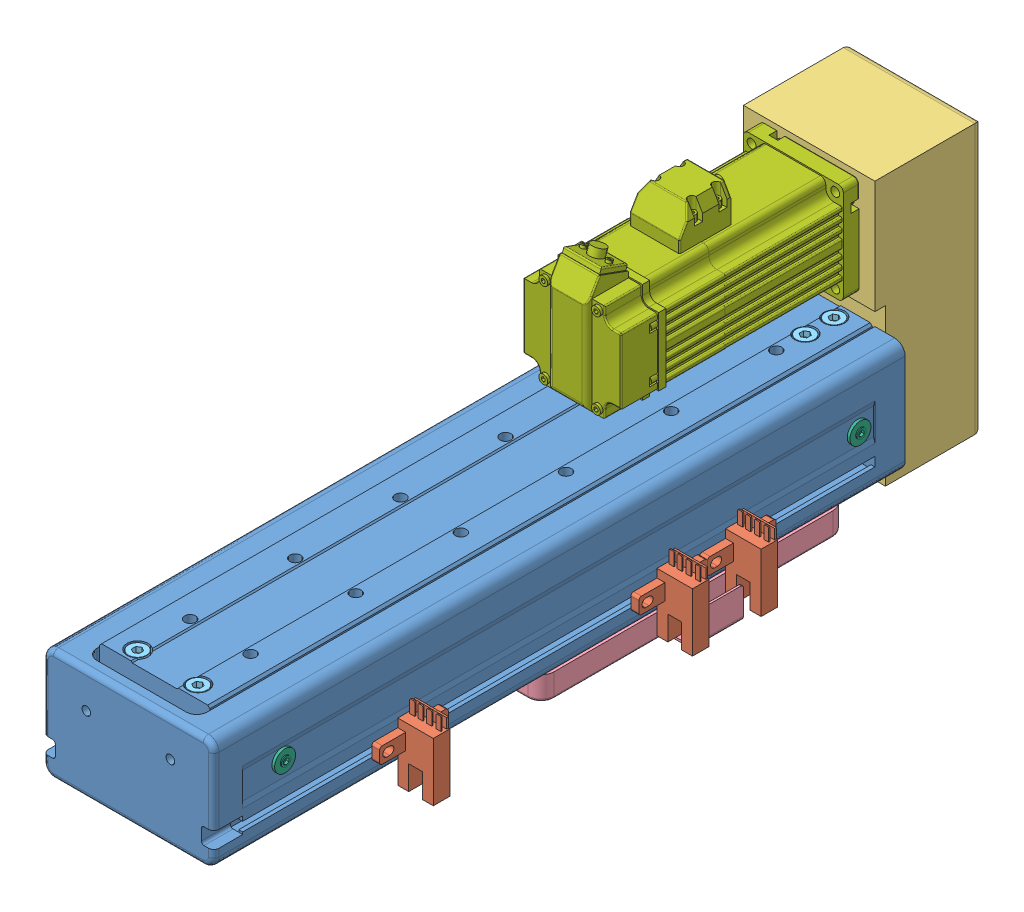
SolidWorks assembly YTH6-100-BM-100W.SLDASM, configuration 默认 (file format 6000). Lengths in mm.
Overall size (79.4 117.8 300).
23 component instances, 7 part files, 60 mates.
Components (placement in the parent):
- 滑轨-YTH6-1: 滑轨-YTH6.SLDPRT [默认] x (-1 0 0) z (0 0 1) size (65 44.9 263)
- OMRON EE-SX672-1: OMRON EE-SX672.SLDPRT [默认] at (39.25 -39.2 185.7) size (13.5 27.2 26.1)
- OMRON EE-SX672-2: OMRON EE-SX672.SLDPRT [默认] at (39.25 -39.2 61) size (13.5 27.2 26.1)
- OMRON EE-SX672-3: OMRON EE-SX672.SLDPRT [默认] at (39.25 -39.2 87.1) size (13.5 27.2 26.1)
- 电机板-YTH6-BM-1: 电机板-YTH6-BM.SLDPRT [默认] at (0 -41.5332 -1) x (0 -1 0) z (1 0 0) size (102.5 41 50)
- 滑座-YTH6-1: 滑座-YTH6.SLDPRT [Default] at (0 -1.5 159.5) x (1 0 0) z (0 1 0) size (69.5 116 25.18)
- GB／T70．1-2000内六角圆柱头螺钉M4×12-1: GB／T70．1-2000内六角圆柱头螺钉M4×12.SLDPRT [默认] at (-11.5 -0.2 16) x (0 -1 0) z (0 0 1) size (16 7 7)
- 内六角圆头带帽螺钉M3×8-1: 内六角圆头带帽螺钉M3×8.SLDPRT [默认] at (-32 -21.7 245) x (0 1 0) z (0 0 1) size (8 9.4 8)
- 内六角圆头带帽螺钉M3×8-2: 内六角圆头带帽螺钉M3×8.SLDPRT [默认] at (-32 -21.7 16.5) x (0 1 0) z (0 0 1) size (8 9.4 8)
- 内六角圆头带帽螺钉M3×8-3: 内六角圆头带帽螺钉M3×8.SLDPRT [默认] at (32 -21.7 16.5) x (0 -1 0) z (0 0 1) size (8 9.4 8)
- 内六角圆头带帽螺钉M3×8-4: 内六角圆头带帽螺钉M3×8.SLDPRT [默认] at (32 -20.287 235.3661) x (0 -1 0) z (0 0 1) size (8 9.4 8)
- 内六角圆头带帽螺钉M3×8-5: 内六角圆头带帽螺钉M3×8.SLDPRT [默认] at (-9.5 -44.9 5) x (-0.837169 0 -0.546944) z (-0.546944 0 0.837169) size (8 9.4 8)
- 内六角圆头带帽螺钉M3×8-6: 内六角圆头带帽螺钉M3×8.SLDPRT [默认] at (9.5 -44.9 5) x (-0.837169 0 -0.546944) z (-0.546944 0 0.837169) size (8 9.4 8)
- 内六角圆头带帽螺钉M3×8-7: 内六角圆头带帽螺钉M3×8.SLDPRT [默认] at (9.5 -44.9 251) x (-0.837169 0 -0.546944) z (-0.546944 0 0.837169) size (8 9.4 8)
- 内六角圆头带帽螺钉M3×8-8: 内六角圆头带帽螺钉M3×8.SLDPRT [默认] at (-9.5 -44.9 251) x (-0.837169 0 -0.546944) z (-0.546944 0 0.837169) size (8 9.4 8)
- 内六角圆头带帽螺钉M3×8-9: 内六角圆头带帽螺钉M3×8.SLDPRT [默认] at (21 -54.9 72) x (-0.837169 0 -0.546944) z (-0.546944 0 0.837169) size (8 9.4 8)
- 内六角圆头带帽螺钉M3×8-10: 内六角圆头带帽螺钉M3×8.SLDPRT [默认] at (21 -54.9 82) x (-0.837169 0 -0.546944) z (-0.546944 0 0.837169) size (8 9.4 8)
- GB／T70．1-2000内六角圆柱头螺钉M4×12-2: GB／T70．1-2000内六角圆柱头螺钉M4×12.SLDPRT [默认] at (11.5 -0.2 16) x (0 -1 0) z (0 0 1) size (16 7 7)
- GB／T70．1-2000内六角圆柱头螺钉M4×12-3: GB／T70．1-2000内六角圆柱头螺钉M4×12.SLDPRT [默认] at (-11.5 -0.2 5) x (0 -1 0) z (0 0 1) size (16 7 7)
- GB／T70．1-2000内六角圆柱头螺钉M4×12-4: GB／T70．1-2000内六角圆柱头螺钉M4×12.SLDPRT [默认] at (11.5 -0.2 5) x (0 -1 0) z (0 0 1) size (16 7 7)
- GB／T70．1-2000内六角圆柱头螺钉M4×12-5: GB／T70．1-2000内六角圆柱头螺钉M4×12.SLDPRT [默认] at (11.5 -0.2 247) x (0 -1 0) z (0 0 1) size (16 7 7)
- GB／T70．1-2000内六角圆柱头螺钉M4×12-6: GB／T70．1-2000内六角圆柱头螺钉M4×12.SLDPRT [默认] at (-11.5 -0.2 247) x (0 -1 0) z (0 0 1) size (16 7 7)
- MSMD01PC_P10-1: MSMD01PC_P10.SLDPRT [默认] at (0 29.5 3) x (-1 0 0) z (0 0 -1) size (38.2 51.1 117)
Mates (geometry in assembly coordinates):
- 重合88: coincident aligned: plane of OMRON EE-SX672-1 through (35.5 -37.4 175.8) normal (0 -1 0); plane of OMRON EE-SX672-2 through (35.5 -37.4 51.1) normal (0 -1 0)
- 重合92: coincident aligned: plane of OMRON EE-SX672-2 through (35.5 -37.4 51.1) normal (0 -1 0); plane of OMRON EE-SX672-3 through (35.5 -37.4 77.2) normal (0 -1 0)
- 重合93: coincident anti-aligned: plane of OMRON EE-SX672-2 through (35.5 -31.3 77.2) normal (0 0 1); plane of OMRON EE-SX672-3 through (35.5 -31.3 77.2) normal (0 0 -1)
- 重合176: coincident anti-aligned: plane of OMRON EE-SX672-2 through (35.5 -31.3 77.2) normal (0 0 1); plane of OMRON EE-SX672-3 through (35.5 -31.3 77.2) normal (0 0 -1)
- 重合233: coincident aligned: plane of 滑座-YTH6-1; plane of assembly through (0 0 0) normal (1 0 0)
- 重合246: coincident aligned: plane of OMRON EE-SX672-2 through (35.5 -37.4 51.1) normal (1 0 0); plane of OMRON EE-SX672-3 through (35.5 -37.4 77.2) normal (1 0 0)
- 距离1: distance = 56 mm anti-aligned: plane of 滑座-YTH6-1 through (21 -56 97) normal (0 -1 0); plane of 滑轨-YTH6-1 through (0 0 252) normal (0 1 0)
- 重合248: coincident aligned: plane of OMRON EE-SX672-2 through (46 -50.3 67.3) normal (1 0 0); plane of OMRON EE-SX672-3 through (46 -50.3 93.4) normal (1 0 0)
- 重合249: coincident aligned: plane of OMRON EE-SX672-1 through (46 -50.3 192) normal (1 0 0); plane of OMRON EE-SX672-3 through (46 -50.3 93.4) normal (1 0 0)
- 重合250: coincident aligned: plane of OMRON EE-SX672-2 through (32.5 -28.1 67.3) normal (0 1 0); plane of OMRON EE-SX672-3 through (32.5 -28.1 93.4) normal (0 1 0)
- 重合251: coincident aligned: plane of OMRON EE-SX672-1 through (32.5 -28.1 192) normal (0 1 0); plane of OMRON EE-SX672-3 through (32.5 -28.1 93.4) normal (0 1 0)
- 距离2: distance = 7.5 mm aligned: plane of 电机板-YTH6-BM-1 through (25 -41.5332 -1) normal (1 0 0); plane of 滑轨-YTH6-1 through (32.5 -39.9 -67.1611) normal (1 0 0)
- 距离3: distance = 8.1 mm aligned: plane of 电机板-YTH6-BM-1 through (-25 -52 3) normal (0 -1 0); plane of 滑轨-YTH6-1 through (0 -43.9 -67.1611) normal (0 -1 0)
- 距离5: distance = 70 mm aligned: plane of OMRON EE-SX672-1 through (46 -28.1 192) normal (0 0 1); plane of 滑轨-YTH6-1 through (0 0 262) normal (0 0 1)
- 距离6: distance = 62 mm aligned: plane of OMRON EE-SX672-2 through (46 -28.1 61) normal (0 0 -1); plane of 滑轨-YTH6-1 through (0 0 -1) normal (0 0 -1)
- 重合257: coincident anti-aligned: plane of 滑轨-YTH6-1 through (0 0 -1) normal (0 0 -1); plane of 电机板-YTH6-BM-1 through (25 -55 -1) normal (0 0 1)
- 重合258: coincident anti-aligned: plane of 滑轨-YTH6-1 through (32.5 -39.9 -67.1611) normal (1 0 0); plane of OMRON EE-SX672-1 through (32.5 -50.3 192) normal (-1 0 0)
- 距离7: distance = 28.1 mm aligned: plane of OMRON EE-SX672-1 through (32.5 -28.1 192) normal (0 1 0); plane of 滑轨-YTH6-1 through (0 0 252) normal (0 1 0)
- 重合260: coincident anti-aligned: plane of 滑轨-YTH6-1; plane of 滑座-YTH6-1
- 重合261: coincident anti-aligned: plane of 滑轨-YTH6-1; plane of assembly through (0 0 0) normal (1 0 0)
- 重合262: coincident anti-aligned: plane of 滑轨-YTH6-1; plane of assembly through (0 0 0) normal (0 1 0)
- 重合263: coincident aligned: plane of 滑轨-YTH6-1 through (0 0 0) normal (0 0 1); plane of assembly through (0 0 0) normal (0 0 1)
- 重合264: coincident aligned: plane of 内六角圆头带帽螺钉M3×8-9 through (21 -54.9 72) normal (0 1 0); plane of 内六角圆头带帽螺钉M3×8-10 through (21 -54.9 82) normal (0 1 0)
- 重合265: coincident anti-aligned: plane of 滑座-YTH6-1 through (27.45 -54.9 77) normal (0 -1 0); plane of 内六角圆头带帽螺钉M3×8-10 through (21 -54.9 82) normal (0 1 0)
- 同心1: concentric aligned: circle of 滑座-YTH6-1; cylinder of 内六角圆头带帽螺钉M3×8-10 through (21 -46.9 82) axis (0 -1 0) radius 1.5
- 同心2: concentric aligned: circle of 滑座-YTH6-1; cylinder of 内六角圆头带帽螺钉M3×8-9 through (21 -46.9 72) axis (0 -1 0) radius 1.5
- 重合266: coincident aligned: plane of 内六角圆头带帽螺钉M3×8-7 through (9.5 -44.9 251) normal (0 1 0); plane of 内六角圆头带帽螺钉M3×8-8 through (-9.5 -44.9 251) normal (0 1 0)
- 重合267: coincident aligned: plane of 内六角圆头带帽螺钉M3×8-6 through (9.5 -44.9 5) normal (0 1 0); plane of 内六角圆头带帽螺钉M3×8-7 through (9.5 -44.9 251) normal (0 1 0)
- 重合268: coincident aligned: plane of 内六角圆头带帽螺钉M3×8-5 through (-9.5 -44.9 5) normal (0 1 0); plane of 内六角圆头带帽螺钉M3×8-6 through (9.5 -44.9 5) normal (0 1 0)
- 重合269: coincident anti-aligned: plane of 滑轨-YTH6-1 through (0 -44.9 0) normal (0 -1 0); plane of 内六角圆头带帽螺钉M3×8-8 through (-9.5 -44.9 251) normal (0 1 0)
- 同心3: concentric aligned: circle of 滑轨-YTH6-1; circle of 内六角圆头带帽螺钉M3×8-5
- 同心4: concentric aligned: circle of 滑轨-YTH6-1; circle of 内六角圆头带帽螺钉M3×8-6
- 同心5: concentric aligned: circle of 滑轨-YTH6-1; circle of 内六角圆头带帽螺钉M3×8-8
- 同心6: concentric aligned: circle of 滑轨-YTH6-1; circle of 内六角圆头带帽螺钉M3×8-7
- 重合270: coincident aligned: plane of 内六角圆头带帽螺钉M3×8-3 through (32 -21.7 16.5) normal (-1 0 0); plane of 内六角圆头带帽螺钉M3×8-4 through (32 -20.287 235.3661) normal (-1 0 0)
- 重合271: coincident anti-aligned: plane of 滑轨-YTH6-1 through (32 -26.5 -67.1611) normal (1 0 0); plane of 内六角圆头带帽螺钉M3×8-4 through (32 -20.287 235.3661) normal (-1 0 0)
- 重合272: coincident aligned: plane of 内六角圆头带帽螺钉M3×8-1 through (-32 -21.7 245) normal (1 0 0); plane of 内六角圆头带帽螺钉M3×8-2 through (-32 -21.7 16.5) normal (1 0 0)
- 重合273: coincident anti-aligned: plane of 滑轨-YTH6-1 through (-32 -26.5 -67.1611) normal (-1 0 0); plane of 内六角圆头带帽螺钉M3×8-2 through (-32 -21.7 16.5) normal (1 0 0)
- 距离8: distance = 1.4 mm: cylinder of 内六角圆头带帽螺钉M3×8-3 through (33 -21.7 16.5) axis (-1 0 0) radius 4; line of 滑轨-YTH6-1 through (32 -16.3 10.5) axis (0 0 1)
- 距离9: distance = 2 mm anti-aligned: cylinder of 内六角圆头带帽螺钉M3×8-3 through (33 -21.7 16.5) axis (-1 0 0) radius 4; plane of 滑轨-YTH6-1 through (-28.5 -5.4 10.5) normal (0 0 1)
- 距离10: distance = 1.4 mm: cylinder of 内六角圆头带帽螺钉M3×8-1 through (-33 -21.7 245) axis (1 0 0) radius 4; line of 滑轨-YTH6-1 through (-32 -16.3 10.5) axis (0 0 1)
- 距离11: distance = 2 mm anti-aligned: cylinder of 内六角圆头带帽螺钉M3×8-1 through (-33 -21.7 245) axis (1 0 0) radius 4; plane of 滑轨-YTH6-1 through (0 0 251) normal (0 0 -1)
- 距离12: distance = 1.4 mm: cylinder of 内六角圆头带帽螺钉M3×8-2 through (-33 -21.7 16.5) axis (1 0 0) radius 4; line of 滑轨-YTH6-1 through (-32 -16.3 10.5) axis (0 0 1)
- 距离13: distance = 2 mm anti-aligned: cylinder of 内六角圆头带帽螺钉M3×8-2 through (-33 -21.7 16.5) axis (1 0 0) radius 4; plane of 滑轨-YTH6-1 through (-28.5 -5.4 10.5) normal (0 0 1)
- 重合277: coincident aligned: plane of GB／T70．1-2000内六角圆柱头螺钉M4×12-1 through (-8 -4.2 16) normal (0 -1 0); plane of GB／T70．1-2000内六角圆柱头螺钉M4×12-2 through (15 -4.2 16) normal (0 -1 0)
- 重合278: coincident aligned: plane of GB／T70．1-2000内六角圆柱头螺钉M4×12-2 through (15 -4.2 16) normal (0 -1 0); plane of GB／T70．1-2000内六角圆柱头螺钉M4×12-3 through (-8 -4.2 5) normal (0 -1 0)
- 重合279: coincident aligned: plane of GB／T70．1-2000内六角圆柱头螺钉M4×12-3 through (-8 -4.2 5) normal (0 -1 0); plane of GB／T70．1-2000内六角圆柱头螺钉M4×12-4 through (15 -4.2 5) normal (0 -1 0)
- 重合280: coincident aligned: plane of GB／T70．1-2000内六角圆柱头螺钉M4×12-5 through (15 -4.2 247) normal (0 -1 0); plane of GB／T70．1-2000内六角圆柱头螺钉M4×12-6 through (-8 -4.2 247) normal (0 -1 0)
- 重合281: coincident aligned: plane of GB／T70．1-2000内六角圆柱头螺钉M4×12-4 through (15 -4.2 5) normal (0 -1 0); plane of GB／T70．1-2000内六角圆柱头螺钉M4×12-5 through (15 -4.2 247) normal (0 -1 0)
- 重合282: coincident anti-aligned: plane of 滑轨-YTH6-1 through (-13.7 -4.2 16) normal (0 1 0); plane of GB／T70．1-2000内六角圆柱头螺钉M4×12-6 through (-8 -4.2 247) normal (0 -1 0)
- 同心7: concentric aligned: circle of 滑轨-YTH6-1; circle of GB／T70．1-2000内六角圆柱头螺钉M4×12-1
- 同心8: concentric aligned: cylinder of 滑轨-YTH6-1 through (11.5 0 16) axis (0 1 0) radius 2.2; cylinder of GB／T70．1-2000内六角圆柱头螺钉M4×12-2 through (11.5 -0.2 16) axis (0 1 0) radius 2
- 同心9: concentric aligned: cylinder of 滑轨-YTH6-1 through (-11.5 0 5) axis (0 1 0) radius 2.1; cylinder of GB／T70．1-2000内六角圆柱头螺钉M4×12-3 through (-11.5 -0.2 5) axis (0 1 0) radius 2
- 同心10: concentric aligned: cylinder of 滑轨-YTH6-1 through (11.5 0 5) axis (0 1 0) radius 2.1; cylinder of GB／T70．1-2000内六角圆柱头螺钉M4×12-4 through (11.5 -0.2 5) axis (0 1 0) radius 2
- 同心11: concentric aligned: circle of 滑轨-YTH6-1; cylinder of GB／T70．1-2000内六角圆柱头螺钉M4×12-5 through (11.5 -0.2 247) axis (0 1 0) radius 2
- 同心12: concentric aligned: circle of 滑轨-YTH6-1; cylinder of GB／T70．1-2000内六角圆柱头螺钉M4×12-6 through (-11.5 -0.2 247) axis (0 1 0) radius 2
- 同心13: concentric anti-aligned: cylinder of 电机板-YTH6-BM-1 through (0 29.5 3) axis (0 0 -1) radius 7.5; cylinder of MSMD01PC_P10-1 through (0 29.5 3) axis (0 0 1) radius 4
- 重合283: coincident anti-aligned: plane of 电机板-YTH6-BM-1 through (25 7.5 3) normal (0 0 1); plane of MSMD01PC_P10-1 through (17.112 46.612 3) normal (0 0 -1)
- 平行1: parallel aligned: plane of 电机板-YTH6-BM-1 through (25 50.5 3) normal (0 1 0); plane of MSMD01PC_P10-1 through (-17.112 48.5 9) normal (0 1 0)
- LimitDistance1: limit distance = 85 mm aligned: plane of 滑座-YTH6-1 through (0 -43.4121 47) normal (0 0 -1); plane of 电机板-YTH6-BM-1 through (0 -41.5332 -38) normal (0 0 -1)
